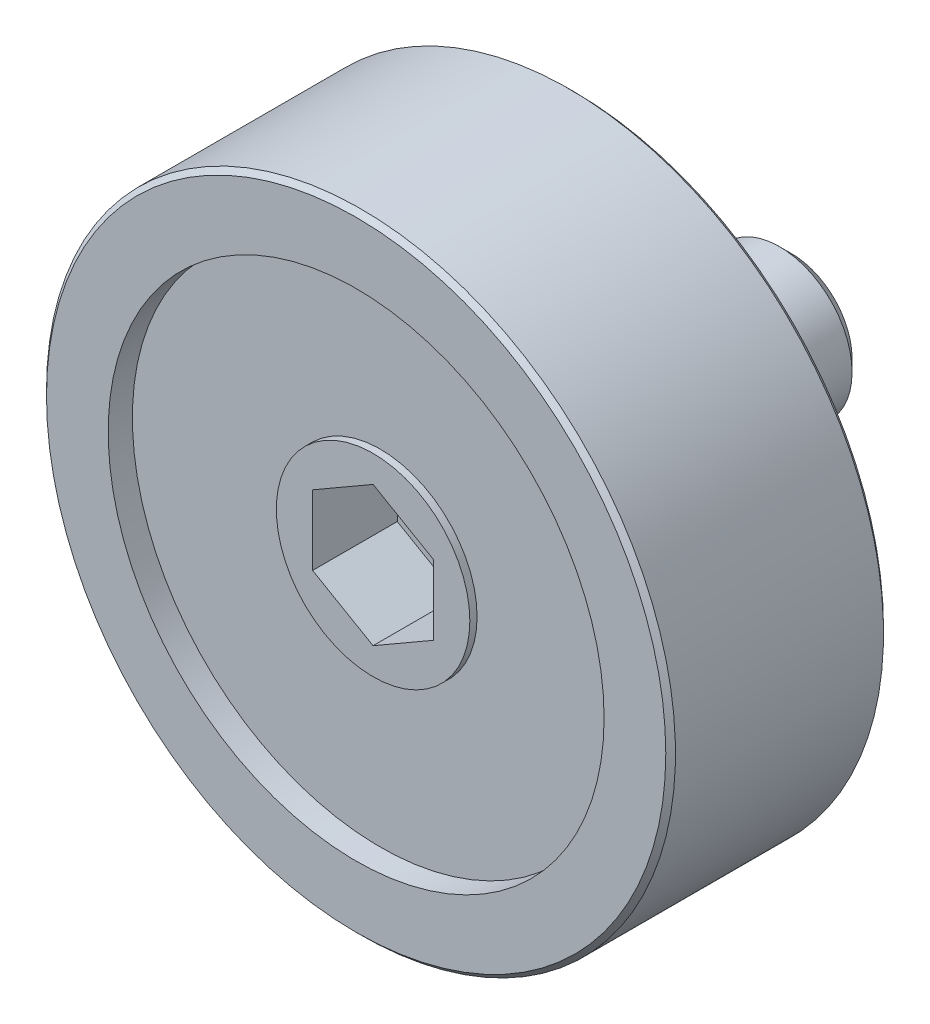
ISO-10303-21;
HEADER;
FILE_DESCRIPTION(('STEP AP214'),'2;1');
FILE_NAME('part.step','',(''),(''),'','','');
FILE_SCHEMA(('AUTOMOTIVE_DESIGN { 1 0 10303 214 1 1 1 1 }'));
ENDSEC;
DATA;
#1=APPLICATION_CONTEXT('core data for automotive mechanical design processes');
#2=APPLICATION_PROTOCOL_DEFINITION('international standard','automotive_design',2000,#1);
#3=PRODUCT_CONTEXT('',#1,'mechanical');
#4=PRODUCT('Part','Part','',(#3));
#5=PRODUCT_RELATED_PRODUCT_CATEGORY('part','',(#4));
#6=PRODUCT_DEFINITION_FORMATION('','',#4);
#7=PRODUCT_DEFINITION_CONTEXT('part definition',#1,'design');
#8=PRODUCT_DEFINITION('design','',#6,#7);
#9=PRODUCT_DEFINITION_SHAPE('','',#8);
#10=(LENGTH_UNIT() NAMED_UNIT(*) SI_UNIT(.MILLI.,.METRE.));
#11=(NAMED_UNIT(*) PLANE_ANGLE_UNIT() SI_UNIT($,.RADIAN.));
#12=(NAMED_UNIT(*) SI_UNIT($,.STERADIAN.) SOLID_ANGLE_UNIT());
#13=UNCERTAINTY_MEASURE_WITH_UNIT(LENGTH_MEASURE(1.E-05),#10,'distance_accuracy_value','');
#14=(GEOMETRIC_REPRESENTATION_CONTEXT(3) GLOBAL_UNCERTAINTY_ASSIGNED_CONTEXT((#13)) GLOBAL_UNIT_ASSIGNED_CONTEXT((#10,
#11,#12)) REPRESENTATION_CONTEXT('',''));
#15=CARTESIAN_POINT('',(0.,0.,0.));
#16=DIRECTION('',(0.,0.,1.));
#17=DIRECTION('',(1.,0.,0.));
#18=AXIS2_PLACEMENT_3D('',#15,#16,#17);
#19=CARTESIAN_POINT('',(0.,14.8,1.));
#20=DIRECTION('',(0.,0.,-1.));
#21=DIRECTION('',(-1.,0.,0.));
#22=AXIS2_PLACEMENT_3D('',#19,#20,#21);
#23=PLANE('',#22);
#24=CARTESIAN_POINT('',(0.,0.,1.));
#25=DIRECTION('',(0.,0.,1.));
#26=DIRECTION('',(1.,0.,0.));
#27=AXIS2_PLACEMENT_3D('',#24,#25,#26);
#28=CIRCLE('',#27,10.25);
#29=CARTESIAN_POINT('',(10.25,0.,1.));
#30=VERTEX_POINT('',#29);
#31=EDGE_CURVE('E9',#30,#30,#28,.T.);
#32=ORIENTED_EDGE('',*,*,#31,.T.);
#33=EDGE_LOOP('',(#32));
#34=FACE_BOUND('',#33,.T.);
#35=CARTESIAN_POINT('',(0.,0.,1.));
#36=DIRECTION('',(0.,0.,-1.));
#37=DIRECTION('',(-1.,0.,0.));
#38=AXIS2_PLACEMENT_3D('',#35,#36,#37);
#39=CIRCLE('',#38,12.8);
#40=CARTESIAN_POINT('',(-12.8,0.,1.));
#41=VERTEX_POINT('',#40);
#42=EDGE_CURVE('E182',#41,#41,#39,.T.);
#43=ORIENTED_EDGE('',*,*,#42,.T.);
#44=EDGE_LOOP('',(#43));
#45=FACE_BOUND('',#44,.T.);
#46=ADVANCED_FACE('F14',(#34,#45),#23,.T.);
#47=CARTESIAN_POINT('',(0.,0.,13.));
#48=DIRECTION('',(0.,0.,1.));
#49=DIRECTION('',(1.,0.,0.));
#50=AXIS2_PLACEMENT_3D('',#47,#48,#49);
#51=CYLINDRICAL_SURFACE('',#50,10.25);
#52=CARTESIAN_POINT('',(0.,0.,2.));
#53=DIRECTION('',(0.,0.,1.));
#54=DIRECTION('',(1.,0.,0.));
#55=AXIS2_PLACEMENT_3D('',#52,#53,#54);
#56=CIRCLE('',#55,10.25);
#57=CARTESIAN_POINT('',(10.25,0.,2.));
#58=VERTEX_POINT('',#57);
#59=EDGE_CURVE('E22',#58,#58,#56,.T.);
#60=ORIENTED_EDGE('',*,*,#59,.T.);
#61=EDGE_LOOP('',(#60));
#62=FACE_BOUND('',#61,.T.);
#63=ORIENTED_EDGE('',*,*,#31,.F.);
#64=EDGE_LOOP('',(#63));
#65=FACE_BOUND('',#64,.T.);
#66=ADVANCED_FACE('F157',(#62,#65),#51,.F.);
#67=CARTESIAN_POINT('',(0.,5.1,2.));
#68=DIRECTION('',(0.,0.,-1.));
#69=DIRECTION('',(-1.,0.,0.));
#70=AXIS2_PLACEMENT_3D('',#67,#68,#69);
#71=PLANE('',#70);
#72=CARTESIAN_POINT('',(0.,0.,2.));
#73=DIRECTION('',(0.,0.,1.));
#74=DIRECTION('',(1.,0.,0.));
#75=AXIS2_PLACEMENT_3D('',#72,#73,#74);
#76=CIRCLE('',#75,5.1);
#77=CARTESIAN_POINT('',(5.1,0.,2.));
#78=VERTEX_POINT('',#77);
#79=EDGE_CURVE('E152',#78,#78,#76,.T.);
#80=ORIENTED_EDGE('',*,*,#79,.T.);
#81=EDGE_LOOP('',(#80));
#82=FACE_BOUND('',#81,.T.);
#83=ORIENTED_EDGE('',*,*,#59,.F.);
#84=EDGE_LOOP('',(#83));
#85=FACE_BOUND('',#84,.T.);
#86=ADVANCED_FACE('F160',(#82,#85),#71,.T.);
#87=CARTESIAN_POINT('',(0.,0.,13.));
#88=DIRECTION('',(0.,0.,1.));
#89=DIRECTION('',(1.,0.,0.));
#90=AXIS2_PLACEMENT_3D('',#87,#88,#89);
#91=CYLINDRICAL_SURFACE('',#90,5.1);
#92=CARTESIAN_POINT('',(0.,0.,0.));
#93=DIRECTION('',(0.,0.,1.));
#94=DIRECTION('',(1.,0.,0.));
#95=AXIS2_PLACEMENT_3D('',#92,#93,#94);
#96=CIRCLE('',#95,5.1);
#97=CARTESIAN_POINT('',(5.1,0.,0.));
#98=VERTEX_POINT('',#97);
#99=EDGE_CURVE('E149',#98,#98,#96,.T.);
#100=ORIENTED_EDGE('',*,*,#99,.T.);
#101=EDGE_LOOP('',(#100));
#102=FACE_BOUND('',#101,.T.);
#103=ORIENTED_EDGE('',*,*,#79,.F.);
#104=EDGE_LOOP('',(#103));
#105=FACE_BOUND('',#104,.T.);
#106=ADVANCED_FACE('F162',(#102,#105),#91,.T.);
#107=CARTESIAN_POINT('',(0.,5.1,0.));
#108=DIRECTION('',(0.,0.,-1.));
#109=DIRECTION('',(-1.,0.,0.));
#110=AXIS2_PLACEMENT_3D('',#107,#108,#109);
#111=PLANE('',#110);
#112=CARTESIAN_POINT('',(0.,0.,0.));
#113=DIRECTION('',(0.,0.,1.));
#114=DIRECTION('',(1.,0.,0.));
#115=AXIS2_PLACEMENT_3D('',#112,#113,#114);
#116=CIRCLE('',#115,2.35);
#117=CARTESIAN_POINT('',(2.35,0.,0.));
#118=VERTEX_POINT('',#117);
#119=EDGE_CURVE('E146',#118,#118,#116,.T.);
#120=ORIENTED_EDGE('',*,*,#119,.T.);
#121=EDGE_LOOP('',(#120));
#122=FACE_BOUND('',#121,.T.);
#123=ORIENTED_EDGE('',*,*,#99,.F.);
#124=EDGE_LOOP('',(#123));
#125=FACE_BOUND('',#124,.T.);
#126=ADVANCED_FACE('F170',(#122,#125),#111,.T.);
#127=CARTESIAN_POINT('',(0.,0.,13.));
#128=DIRECTION('',(0.,0.,1.));
#129=DIRECTION('',(1.,0.,0.));
#130=AXIS2_PLACEMENT_3D('',#127,#128,#129);
#131=CYLINDRICAL_SURFACE('',#130,2.35);
#132=CARTESIAN_POINT('',(0.,0.,-2.));
#133=DIRECTION('',(0.,0.,1.));
#134=DIRECTION('',(1.,0.,0.));
#135=AXIS2_PLACEMENT_3D('',#132,#133,#134);
#136=CIRCLE('',#135,2.35);
#137=CARTESIAN_POINT('',(2.35,0.,-2.));
#138=VERTEX_POINT('',#137);
#139=EDGE_CURVE('E143',#138,#138,#136,.T.);
#140=ORIENTED_EDGE('',*,*,#139,.T.);
#141=EDGE_LOOP('',(#140));
#142=FACE_BOUND('',#141,.T.);
#143=ORIENTED_EDGE('',*,*,#119,.F.);
#144=EDGE_LOOP('',(#143));
#145=FACE_BOUND('',#144,.T.);
#146=ADVANCED_FACE('F253',(#142,#145),#131,.T.);
#147=CARTESIAN_POINT('',(0.,2.35,-2.));
#148=DIRECTION('',(0.,0.,1.));
#149=DIRECTION('',(1.,0.,0.));
#150=AXIS2_PLACEMENT_3D('',#147,#148,#149);
#151=PLANE('',#150);
#152=CARTESIAN_POINT('',(0.,0.,-2.));
#153=DIRECTION('',(0.,0.,1.));
#154=DIRECTION('',(1.,0.,0.));
#155=AXIS2_PLACEMENT_3D('',#152,#153,#154);
#156=CIRCLE('',#155,3.);
#157=CARTESIAN_POINT('',(3.,0.,-2.));
#158=VERTEX_POINT('',#157);
#159=EDGE_CURVE('E140',#158,#158,#156,.T.);
#160=ORIENTED_EDGE('',*,*,#159,.T.);
#161=EDGE_LOOP('',(#160));
#162=FACE_BOUND('',#161,.T.);
#163=ORIENTED_EDGE('',*,*,#139,.F.);
#164=EDGE_LOOP('',(#163));
#165=FACE_BOUND('',#164,.T.);
#166=ADVANCED_FACE('F249',(#162,#165),#151,.T.);
#167=CARTESIAN_POINT('',(0.,0.,13.));
#168=DIRECTION('',(0.,0.,1.));
#169=DIRECTION('',(1.,0.,0.));
#170=AXIS2_PLACEMENT_3D('',#167,#168,#169);
#171=CYLINDRICAL_SURFACE('',#170,3.);
#172=CARTESIAN_POINT('',(0.,0.,-7.5));
#173=DIRECTION('',(0.,0.,1.));
#174=DIRECTION('',(1.,0.,0.));
#175=AXIS2_PLACEMENT_3D('',#172,#173,#174);
#176=CIRCLE('',#175,3.);
#177=CARTESIAN_POINT('',(3.,0.,-7.5));
#178=VERTEX_POINT('',#177);
#179=EDGE_CURVE('E137',#178,#178,#176,.T.);
#180=ORIENTED_EDGE('',*,*,#179,.T.);
#181=EDGE_LOOP('',(#180));
#182=FACE_BOUND('',#181,.T.);
#183=ORIENTED_EDGE('',*,*,#159,.F.);
#184=EDGE_LOOP('',(#183));
#185=FACE_BOUND('',#184,.T.);
#186=ADVANCED_FACE('F245',(#182,#185),#171,.T.);
#187=CARTESIAN_POINT('',(0.,0.,-7.5));
#188=DIRECTION('',(0.,0.,1.));
#189=DIRECTION('',(1.,0.,0.));
#190=AXIS2_PLACEMENT_3D('',#187,#188,#189);
#191=CONICAL_SURFACE('',#190,3.,0.785398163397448);
#192=CARTESIAN_POINT('',(0.,0.,-8.));
#193=DIRECTION('',(0.,0.,1.));
#194=DIRECTION('',(1.,0.,0.));
#195=AXIS2_PLACEMENT_3D('',#192,#193,#194);
#196=CIRCLE('',#195,2.5);
#197=CARTESIAN_POINT('',(2.5,0.,-8.));
#198=VERTEX_POINT('',#197);
#199=EDGE_CURVE('E134',#198,#198,#196,.T.);
#200=ORIENTED_EDGE('',*,*,#199,.T.);
#201=EDGE_LOOP('',(#200));
#202=FACE_BOUND('',#201,.T.);
#203=ORIENTED_EDGE('',*,*,#179,.F.);
#204=EDGE_LOOP('',(#203));
#205=FACE_BOUND('',#204,.T.);
#206=ADVANCED_FACE('F241',(#202,#205),#191,.T.);
#207=CARTESIAN_POINT('',(0.,0.,-8.));
#208=DIRECTION('',(0.,0.,-1.));
#209=DIRECTION('',(-1.,0.,0.));
#210=AXIS2_PLACEMENT_3D('',#207,#208,#209);
#211=PLANE('',#210);
#212=ORIENTED_EDGE('',*,*,#199,.F.);
#213=EDGE_LOOP('',(#212));
#214=FACE_BOUND('',#213,.T.);
#215=ADVANCED_FACE('F237',(#214),#211,.T.);
#216=CARTESIAN_POINT('',(0.,0.,1.2));
#217=DIRECTION('',(0.,0.,-1.));
#218=DIRECTION('',(-1.,0.,0.));
#219=AXIS2_PLACEMENT_3D('',#216,#217,#218);
#220=CYLINDRICAL_SURFACE('',#219,13.);
#221=CARTESIAN_POINT('',(0.,0.,1.2));
#222=DIRECTION('',(0.,0.,-1.));
#223=DIRECTION('',(-1.,0.,0.));
#224=AXIS2_PLACEMENT_3D('',#221,#222,#223);
#225=CIRCLE('',#224,13.);
#226=CARTESIAN_POINT('',(-13.,0.,1.2));
#227=VERTEX_POINT('',#226);
#228=EDGE_CURVE('E185',#227,#227,#225,.T.);
#229=ORIENTED_EDGE('',*,*,#228,.F.);
#230=EDGE_LOOP('',(#229));
#231=FACE_BOUND('',#230,.T.);
#232=CARTESIAN_POINT('',(0.,0.,9.79999999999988));
#233=DIRECTION('',(0.,0.,-1.));
#234=DIRECTION('',(-1.,0.,0.));
#235=AXIS2_PLACEMENT_3D('',#232,#233,#234);
#236=CIRCLE('',#235,13.);
#237=CARTESIAN_POINT('',(-13.,0.,9.79999999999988));
#238=VERTEX_POINT('',#237);
#239=EDGE_CURVE('E104',#238,#238,#236,.T.);
#240=ORIENTED_EDGE('',*,*,#239,.T.);
#241=EDGE_LOOP('',(#240));
#242=FACE_BOUND('',#241,.T.);
#243=ADVANCED_FACE('F240',(#231,#242),#220,.T.);
#244=CARTESIAN_POINT('',(0.,0.,9.99999999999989));
#245=DIRECTION('',(0.,0.,-1.));
#246=DIRECTION('',(-1.,0.,0.));
#247=AXIS2_PLACEMENT_3D('',#244,#245,#246);
#248=CONICAL_SURFACE('',#247,12.8,0.785398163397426);
#249=ORIENTED_EDGE('',*,*,#239,.F.);
#250=EDGE_LOOP('',(#249));
#251=FACE_BOUND('',#250,.T.);
#252=CARTESIAN_POINT('',(0.,0.,9.99999999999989));
#253=DIRECTION('',(0.,0.,-1.));
#254=DIRECTION('',(-1.,0.,0.));
#255=AXIS2_PLACEMENT_3D('',#252,#253,#254);
#256=CIRCLE('',#255,12.8);
#257=CARTESIAN_POINT('',(-12.8,0.,9.99999999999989));
#258=VERTEX_POINT('',#257);
#259=EDGE_CURVE('E184',#258,#258,#256,.T.);
#260=ORIENTED_EDGE('',*,*,#259,.T.);
#261=EDGE_LOOP('',(#260));
#262=FACE_BOUND('',#261,.T.);
#263=ADVANCED_FACE('F304',(#251,#262),#248,.T.);
#264=CARTESIAN_POINT('',(0.,0.,1.2));
#265=DIRECTION('',(0.,0.,1.));
#266=DIRECTION('',(1.,0.,0.));
#267=AXIS2_PLACEMENT_3D('',#264,#265,#266);
#268=CONICAL_SURFACE('',#267,13.,0.78539816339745);
#269=ORIENTED_EDGE('',*,*,#42,.F.);
#270=EDGE_LOOP('',(#269));
#271=FACE_BOUND('',#270,.T.);
#272=ORIENTED_EDGE('',*,*,#228,.T.);
#273=EDGE_LOOP('',(#272));
#274=FACE_BOUND('',#273,.T.);
#275=ADVANCED_FACE('F312',(#271,#274),#268,.T.);
#276=CARTESIAN_POINT('',(0.,0.,5.8));
#277=DIRECTION('',(0.,0.,1.));
#278=DIRECTION('',(1.,0.,0.));
#279=AXIS2_PLACEMENT_3D('',#276,#277,#278);
#280=PLANE('',#279);
#281=DIRECTION('',(-0.866025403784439,0.5,0.));
#282=VECTOR('',#281,1.);
#283=CARTESIAN_POINT('',(2.5,1.44337567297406,5.8));
#284=LINE('',#283,#282);
#285=CARTESIAN_POINT('',(2.5,1.44337567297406,5.8));
#286=VERTEX_POINT('',#285);
#287=CARTESIAN_POINT('',(0.,2.88675134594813,5.8));
#288=VERTEX_POINT('',#287);
#289=EDGE_CURVE('E115',#286,#288,#284,.T.);
#290=ORIENTED_EDGE('',*,*,#289,.T.);
#291=DIRECTION('',(-0.866025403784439,-0.5,0.));
#292=VECTOR('',#291,1.);
#293=CARTESIAN_POINT('',(0.,2.88675134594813,5.8));
#294=LINE('',#293,#292);
#295=CARTESIAN_POINT('',(-2.5,1.44337567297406,5.8));
#296=VERTEX_POINT('',#295);
#297=EDGE_CURVE('E97',#288,#296,#294,.T.);
#298=ORIENTED_EDGE('',*,*,#297,.T.);
#299=DIRECTION('',(0.,-1.,0.));
#300=VECTOR('',#299,1.);
#301=CARTESIAN_POINT('',(-2.5,1.44337567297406,5.8));
#302=LINE('',#301,#300);
#303=CARTESIAN_POINT('',(-2.5,-1.44337567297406,5.8));
#304=VERTEX_POINT('',#303);
#305=EDGE_CURVE('E95',#296,#304,#302,.T.);
#306=ORIENTED_EDGE('',*,*,#305,.T.);
#307=DIRECTION('',(0.866025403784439,-0.5,0.));
#308=VECTOR('',#307,1.);
#309=CARTESIAN_POINT('',(-2.5,-1.44337567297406,5.8));
#310=LINE('',#309,#308);
#311=CARTESIAN_POINT('',(0.,-2.88675134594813,5.8));
#312=VERTEX_POINT('',#311);
#313=EDGE_CURVE('E74',#304,#312,#310,.T.);
#314=ORIENTED_EDGE('',*,*,#313,.T.);
#315=DIRECTION('',(0.866025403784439,0.5,0.));
#316=VECTOR('',#315,1.);
#317=CARTESIAN_POINT('',(0.,-2.88675134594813,5.8));
#318=LINE('',#317,#316);
#319=CARTESIAN_POINT('',(2.5,-1.44337567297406,5.8));
#320=VERTEX_POINT('',#319);
#321=EDGE_CURVE('E85',#312,#320,#318,.T.);
#322=ORIENTED_EDGE('',*,*,#321,.T.);
#323=DIRECTION('',(0.,1.,0.));
#324=VECTOR('',#323,1.);
#325=CARTESIAN_POINT('',(2.5,-1.44337567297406,5.8));
#326=LINE('',#325,#324);
#327=EDGE_CURVE('E89',#320,#286,#326,.T.);
#328=ORIENTED_EDGE('',*,*,#327,.T.);
#329=EDGE_LOOP('',(#290,#298,#306,#314,#322,#328));
#330=FACE_BOUND('',#329,.T.);
#331=ADVANCED_FACE('F92',(#330),#280,.T.);
#332=CARTESIAN_POINT('',(0.,2.88675134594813,5.8));
#333=DIRECTION('',(-0.5,0.866025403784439,0.));
#334=DIRECTION('',(-0.866025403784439,-0.5,0.));
#335=AXIS2_PLACEMENT_3D('',#332,#333,#334);
#336=PLANE('',#335);
#337=DIRECTION('',(-0.866025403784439,-0.5,0.));
#338=VECTOR('',#337,1.);
#339=CARTESIAN_POINT('',(0.,2.88675134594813,9.3));
#340=LINE('',#339,#338);
#341=CARTESIAN_POINT('',(0.,2.88675134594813,9.3));
#342=VERTEX_POINT('',#341);
#343=CARTESIAN_POINT('',(-2.5,1.44337567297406,9.3));
#344=VERTEX_POINT('',#343);
#345=EDGE_CURVE('E103',#342,#344,#340,.T.);
#346=ORIENTED_EDGE('',*,*,#345,.T.);
#347=DIRECTION('',(0.,0.,1.));
#348=VECTOR('',#347,1.);
#349=CARTESIAN_POINT('',(-2.5,1.44337567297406,5.8));
#350=LINE('',#349,#348);
#351=EDGE_CURVE('E120',#296,#344,#350,.T.);
#352=ORIENTED_EDGE('',*,*,#351,.F.);
#353=ORIENTED_EDGE('',*,*,#297,.F.);
#354=DIRECTION('',(0.,0.,1.));
#355=VECTOR('',#354,1.);
#356=CARTESIAN_POINT('',(0.,2.88675134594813,5.8));
#357=LINE('',#356,#355);
#358=EDGE_CURVE('E59',#288,#342,#357,.T.);
#359=ORIENTED_EDGE('',*,*,#358,.T.);
#360=EDGE_LOOP('',(#346,#352,#353,#359));
#361=FACE_BOUND('',#360,.T.);
#362=ADVANCED_FACE('F195',(#361),#336,.F.);
#363=CARTESIAN_POINT('',(-2.5,1.44337567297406,5.8));
#364=DIRECTION('',(-1.,0.,0.));
#365=DIRECTION('',(0.,-1.,0.));
#366=AXIS2_PLACEMENT_3D('',#363,#364,#365);
#367=PLANE('',#366);
#368=DIRECTION('',(0.,-1.,0.));
#369=VECTOR('',#368,1.);
#370=CARTESIAN_POINT('',(-2.5,1.44337567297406,9.3));
#371=LINE('',#370,#369);
#372=CARTESIAN_POINT('',(-2.5,-1.44337567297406,9.3));
#373=VERTEX_POINT('',#372);
#374=EDGE_CURVE('E107',#344,#373,#371,.T.);
#375=ORIENTED_EDGE('',*,*,#374,.T.);
#376=DIRECTION('',(0.,0.,1.));
#377=VECTOR('',#376,1.);
#378=CARTESIAN_POINT('',(-2.5,-1.44337567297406,5.8));
#379=LINE('',#378,#377);
#380=EDGE_CURVE('E82',#304,#373,#379,.T.);
#381=ORIENTED_EDGE('',*,*,#380,.F.);
#382=ORIENTED_EDGE('',*,*,#305,.F.);
#383=ORIENTED_EDGE('',*,*,#351,.T.);
#384=EDGE_LOOP('',(#375,#381,#382,#383));
#385=FACE_BOUND('',#384,.T.);
#386=ADVANCED_FACE('F199',(#385),#367,.F.);
#387=CARTESIAN_POINT('',(-2.5,-1.44337567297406,5.8));
#388=DIRECTION('',(-0.5,-0.866025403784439,0.));
#389=DIRECTION('',(0.866025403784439,-0.5,0.));
#390=AXIS2_PLACEMENT_3D('',#387,#388,#389);
#391=PLANE('',#390);
#392=DIRECTION('',(0.866025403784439,-0.5,0.));
#393=VECTOR('',#392,1.);
#394=CARTESIAN_POINT('',(-2.5,-1.44337567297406,9.3));
#395=LINE('',#394,#393);
#396=CARTESIAN_POINT('',(0.,-2.88675134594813,9.3));
#397=VERTEX_POINT('',#396);
#398=EDGE_CURVE('E77',#373,#397,#395,.T.);
#399=ORIENTED_EDGE('',*,*,#398,.T.);
#400=DIRECTION('',(0.,0.,1.));
#401=VECTOR('',#400,1.);
#402=CARTESIAN_POINT('',(0.,-2.88675134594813,5.8));
#403=LINE('',#402,#401);
#404=EDGE_CURVE('E70',#312,#397,#403,.T.);
#405=ORIENTED_EDGE('',*,*,#404,.F.);
#406=ORIENTED_EDGE('',*,*,#313,.F.);
#407=ORIENTED_EDGE('',*,*,#380,.T.);
#408=EDGE_LOOP('',(#399,#405,#406,#407));
#409=FACE_BOUND('',#408,.T.);
#410=ADVANCED_FACE('F72',(#409),#391,.F.);
#411=CARTESIAN_POINT('',(0.,-2.88675134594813,5.8));
#412=DIRECTION('',(0.5,-0.866025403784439,0.));
#413=DIRECTION('',(0.866025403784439,0.5,0.));
#414=AXIS2_PLACEMENT_3D('',#411,#412,#413);
#415=PLANE('',#414);
#416=DIRECTION('',(0.866025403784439,0.5,0.));
#417=VECTOR('',#416,1.);
#418=CARTESIAN_POINT('',(0.,-2.88675134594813,9.3));
#419=LINE('',#418,#417);
#420=CARTESIAN_POINT('',(2.5,-1.44337567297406,9.3));
#421=VERTEX_POINT('',#420);
#422=EDGE_CURVE('E111',#397,#421,#419,.T.);
#423=ORIENTED_EDGE('',*,*,#422,.T.);
#424=DIRECTION('',(0.,0.,1.));
#425=VECTOR('',#424,1.);
#426=CARTESIAN_POINT('',(2.5,-1.44337567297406,5.8));
#427=LINE('',#426,#425);
#428=EDGE_CURVE('E81',#320,#421,#427,.T.);
#429=ORIENTED_EDGE('',*,*,#428,.F.);
#430=ORIENTED_EDGE('',*,*,#321,.F.);
#431=ORIENTED_EDGE('',*,*,#404,.T.);
#432=EDGE_LOOP('',(#423,#429,#430,#431));
#433=FACE_BOUND('',#432,.T.);
#434=ADVANCED_FACE('F86',(#433),#415,.F.);
#435=CARTESIAN_POINT('',(2.5,-1.44337567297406,5.8));
#436=DIRECTION('',(1.,0.,0.));
#437=DIRECTION('',(0.,0.,-1.));
#438=AXIS2_PLACEMENT_3D('',#435,#436,#437);
#439=PLANE('',#438);
#440=DIRECTION('',(0.,1.,0.));
#441=VECTOR('',#440,1.);
#442=CARTESIAN_POINT('',(2.5,-1.44337567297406,9.3));
#443=LINE('',#442,#441);
#444=CARTESIAN_POINT('',(2.5,1.44337567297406,9.3));
#445=VERTEX_POINT('',#444);
#446=EDGE_CURVE('E113',#421,#445,#443,.T.);
#447=ORIENTED_EDGE('',*,*,#446,.T.);
#448=DIRECTION('',(0.,0.,1.));
#449=VECTOR('',#448,1.);
#450=CARTESIAN_POINT('',(2.5,1.44337567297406,5.8));
#451=LINE('',#450,#449);
#452=EDGE_CURVE('E37',#286,#445,#451,.T.);
#453=ORIENTED_EDGE('',*,*,#452,.F.);
#454=ORIENTED_EDGE('',*,*,#327,.F.);
#455=ORIENTED_EDGE('',*,*,#428,.T.);
#456=EDGE_LOOP('',(#447,#453,#454,#455));
#457=FACE_BOUND('',#456,.T.);
#458=ADVANCED_FACE('F204',(#457),#439,.F.);
#459=CARTESIAN_POINT('',(2.5,1.44337567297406,5.8));
#460=DIRECTION('',(0.5,0.866025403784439,0.));
#461=DIRECTION('',(-0.866025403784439,0.5,0.));
#462=AXIS2_PLACEMENT_3D('',#459,#460,#461);
#463=PLANE('',#462);
#464=DIRECTION('',(-0.866025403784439,0.5,0.));
#465=VECTOR('',#464,1.);
#466=CARTESIAN_POINT('',(2.5,1.44337567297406,9.3));
#467=LINE('',#466,#465);
#468=EDGE_CURVE('E29',#445,#342,#467,.T.);
#469=ORIENTED_EDGE('',*,*,#468,.T.);
#470=ORIENTED_EDGE('',*,*,#358,.F.);
#471=ORIENTED_EDGE('',*,*,#289,.F.);
#472=ORIENTED_EDGE('',*,*,#452,.T.);
#473=EDGE_LOOP('',(#469,#470,#471,#472));
#474=FACE_BOUND('',#473,.T.);
#475=ADVANCED_FACE('F206',(#474),#463,.F.);
#476=CARTESIAN_POINT('',(0.,4.00000000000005,9.3));
#477=DIRECTION('',(0.,0.,1.));
#478=DIRECTION('',(1.,0.,0.));
#479=AXIS2_PLACEMENT_3D('',#476,#477,#478);
#480=PLANE('',#479);
#481=ORIENTED_EDGE('',*,*,#468,.F.);
#482=ORIENTED_EDGE('',*,*,#446,.F.);
#483=ORIENTED_EDGE('',*,*,#422,.F.);
#484=ORIENTED_EDGE('',*,*,#398,.F.);
#485=ORIENTED_EDGE('',*,*,#374,.F.);
#486=ORIENTED_EDGE('',*,*,#345,.F.);
#487=EDGE_LOOP('',(#481,#482,#483,#484,#485,#486));
#488=FACE_BOUND('',#487,.T.);
#489=CARTESIAN_POINT('',(0.,0.,9.3));
#490=DIRECTION('',(0.,0.,1.));
#491=DIRECTION('',(1.,0.,0.));
#492=AXIS2_PLACEMENT_3D('',#489,#490,#491);
#493=CIRCLE('',#492,4.00000000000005);
#494=CARTESIAN_POINT('',(4.00000000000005,0.,9.3));
#495=VERTEX_POINT('',#494);
#496=EDGE_CURVE('E131',#495,#495,#493,.T.);
#497=ORIENTED_EDGE('',*,*,#496,.T.);
#498=EDGE_LOOP('',(#497));
#499=FACE_BOUND('',#498,.T.);
#500=ADVANCED_FACE('F201',(#488,#499),#480,.T.);
#501=CARTESIAN_POINT('',(0.,0.,13.));
#502=DIRECTION('',(0.,0.,1.));
#503=DIRECTION('',(1.,0.,0.));
#504=AXIS2_PLACEMENT_3D('',#501,#502,#503);
#505=CYLINDRICAL_SURFACE('',#504,4.00000000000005);
#506=CARTESIAN_POINT('',(0.,0.,9.));
#507=DIRECTION('',(0.,0.,1.));
#508=DIRECTION('',(1.,0.,0.));
#509=AXIS2_PLACEMENT_3D('',#506,#507,#508);
#510=CIRCLE('',#509,4.00000000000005);
#511=CARTESIAN_POINT('',(4.00000000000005,0.,9.));
#512=VERTEX_POINT('',#511);
#513=EDGE_CURVE('E128',#512,#512,#510,.T.);
#514=ORIENTED_EDGE('',*,*,#513,.T.);
#515=EDGE_LOOP('',(#514));
#516=FACE_BOUND('',#515,.T.);
#517=ORIENTED_EDGE('',*,*,#496,.F.);
#518=EDGE_LOOP('',(#517));
#519=FACE_BOUND('',#518,.T.);
#520=ADVANCED_FACE('F230',(#516,#519),#505,.T.);
#521=CARTESIAN_POINT('',(0.,10.25,9.));
#522=DIRECTION('',(0.,0.,1.));
#523=DIRECTION('',(1.,0.,0.));
#524=AXIS2_PLACEMENT_3D('',#521,#522,#523);
#525=PLANE('',#524);
#526=CARTESIAN_POINT('',(0.,0.,9.));
#527=DIRECTION('',(0.,0.,1.));
#528=DIRECTION('',(1.,0.,0.));
#529=AXIS2_PLACEMENT_3D('',#526,#527,#528);
#530=CIRCLE('',#529,10.25);
#531=CARTESIAN_POINT('',(10.25,0.,9.));
#532=VERTEX_POINT('',#531);
#533=EDGE_CURVE('E125',#532,#532,#530,.T.);
#534=ORIENTED_EDGE('',*,*,#533,.T.);
#535=EDGE_LOOP('',(#534));
#536=FACE_BOUND('',#535,.T.);
#537=ORIENTED_EDGE('',*,*,#513,.F.);
#538=EDGE_LOOP('',(#537));
#539=FACE_BOUND('',#538,.T.);
#540=ADVANCED_FACE('F226',(#536,#539),#525,.T.);
#541=CARTESIAN_POINT('',(0.,0.,13.));
#542=DIRECTION('',(0.,0.,1.));
#543=DIRECTION('',(1.,0.,0.));
#544=AXIS2_PLACEMENT_3D('',#541,#542,#543);
#545=CYLINDRICAL_SURFACE('',#544,10.25);
#546=CARTESIAN_POINT('',(0.,0.,10.));
#547=DIRECTION('',(0.,0.,1.));
#548=DIRECTION('',(1.,0.,0.));
#549=AXIS2_PLACEMENT_3D('',#546,#547,#548);
#550=CIRCLE('',#549,10.25);
#551=CARTESIAN_POINT('',(10.25,0.,10.));
#552=VERTEX_POINT('',#551);
#553=EDGE_CURVE('E117',#552,#552,#550,.T.);
#554=ORIENTED_EDGE('',*,*,#553,.T.);
#555=EDGE_LOOP('',(#554));
#556=FACE_BOUND('',#555,.T.);
#557=ORIENTED_EDGE('',*,*,#533,.F.);
#558=EDGE_LOOP('',(#557));
#559=FACE_BOUND('',#558,.T.);
#560=ADVANCED_FACE('F223',(#556,#559),#545,.F.);
#561=CARTESIAN_POINT('',(0.,14.8,10.));
#562=DIRECTION('',(0.,0.,1.));
#563=DIRECTION('',(1.,0.,0.));
#564=AXIS2_PLACEMENT_3D('',#561,#562,#563);
#565=PLANE('',#564);
#566=ORIENTED_EDGE('',*,*,#553,.F.);
#567=EDGE_LOOP('',(#566));
#568=FACE_BOUND('',#567,.T.);
#569=ORIENTED_EDGE('',*,*,#259,.F.);
#570=EDGE_LOOP('',(#569));
#571=FACE_BOUND('',#570,.T.);
#572=ADVANCED_FACE('F16',(#568,#571),#565,.T.);
#573=CLOSED_SHELL('',(#46,#66,#86,#106,#126,#146,#166,#186,#206,#215,#243,#263,#275,#331,#362,
#386,#410,#434,#458,#475,#500,#520,#540,#560,#572));
#574=MANIFOLD_SOLID_BREP('B1',#573);
#575=ADVANCED_BREP_SHAPE_REPRESENTATION('',(#18,#574),#14);
#576=SHAPE_DEFINITION_REPRESENTATION(#9,#575);
ENDSEC;
END-ISO-10303-21;
